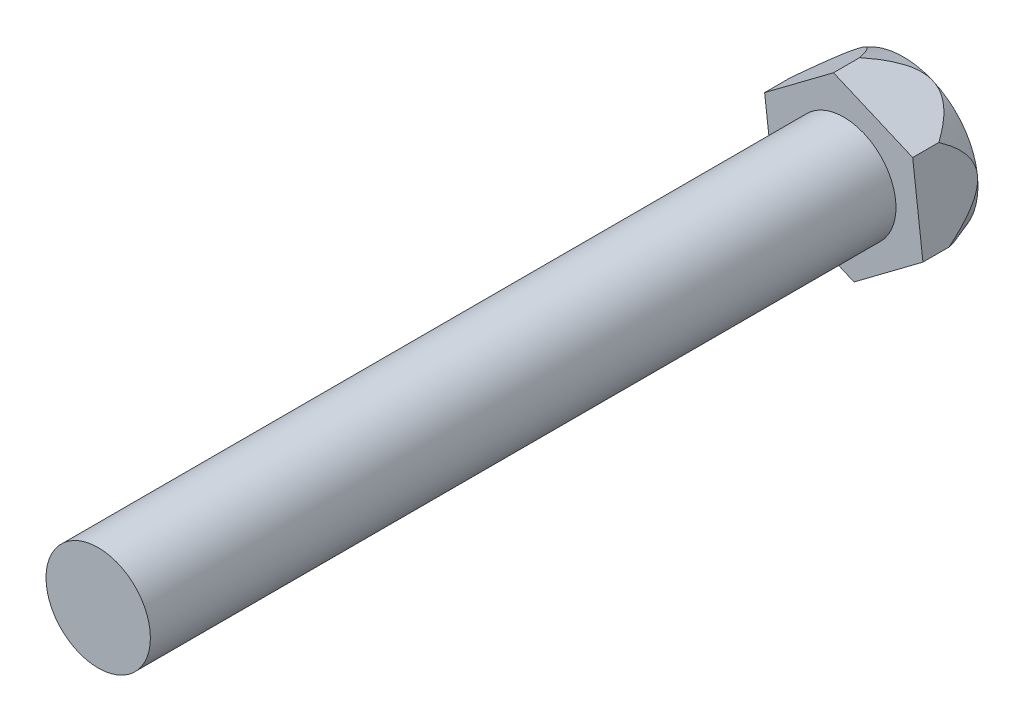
from build123d import *

# Parameters (mm, degrees)
SKETCH10_R          = 1.75
BOSS_EXTRUDE1_DEPTH = 25
BOSS_EXTRUDE2_DEPTH = 2
SKETCH14_OUTSIDE_W  = 14.306
SKETCH14_OUTSIDE_H  = 14.73
SKETCH14_OUTSIDE_R  = 2.5
CUT_EXTRUDE1_DEPTH  = 2
CUT_EXTRUDE1_DRAFT  = -19


with BuildPart() as part:
    # Sketch10 → Boss-Extrude1 (new body)
    with BuildSketch(Plane.XY):
        Circle(SKETCH10_R)
    extrude(amount=BOSS_EXTRUDE1_DEPTH)

    # Sketch13 → Boss-Extrude2 (add)
    with BuildSketch(Plane(origin=(0, 0, 0), x_dir=(-1, 0, 0), z_dir=(0, 0, -1))):
        Polygon((0.344365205, 2.866137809), (-2.30996555, 1.73129792), (-2.654330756, -1.134839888), (-0.344365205, -2.866137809), (2.30996555, -1.73129792), (2.654330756, 1.134839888), align=None)
    extrude(amount=BOSS_EXTRUDE2_DEPTH)


with BuildPart() as cut_extrude1_tool:
    # Sketch14 outside → Cut-Extrude1 (with draft: the straight prism first)
    with BuildSketch(Plane(origin=(0, 0, -2), x_dir=(-1, 0, 0), z_dir=(0, 0, -1))):
        Rectangle(SKETCH14_OUTSIDE_W, SKETCH14_OUTSIDE_H)
        Circle(SKETCH14_OUTSIDE_R, mode=Mode.SUBTRACT)
    extrude(amount=-CUT_EXTRUDE1_DEPTH)
    # Cut-Extrude1: the draft: its side faces are tilted about the plane it starts from
    cut_extrude1_sides = [cut_extrude1_tool.faces().sort_by_distance(p)[0] for p in [
        (0, -7.365, -1),
        (-7.153, 0, -1),
        (0, 7.365, -1),
        (7.153, 0, -1),
        (2.5, 0, -1),
    ]]
    draft(cut_extrude1_sides, Plane(origin=(0, 0, -2), x_dir=(-1, 0, 0), z_dir=(0, 0, -1)), CUT_EXTRUDE1_DRAFT)


with BuildPart() as part_1:
    add(part.part)

    # Cut-Extrude1: cut by cut_extrude1_tool
    add(cut_extrude1_tool.part, mode=Mode.SUBTRACT)


solid = part_1.part
